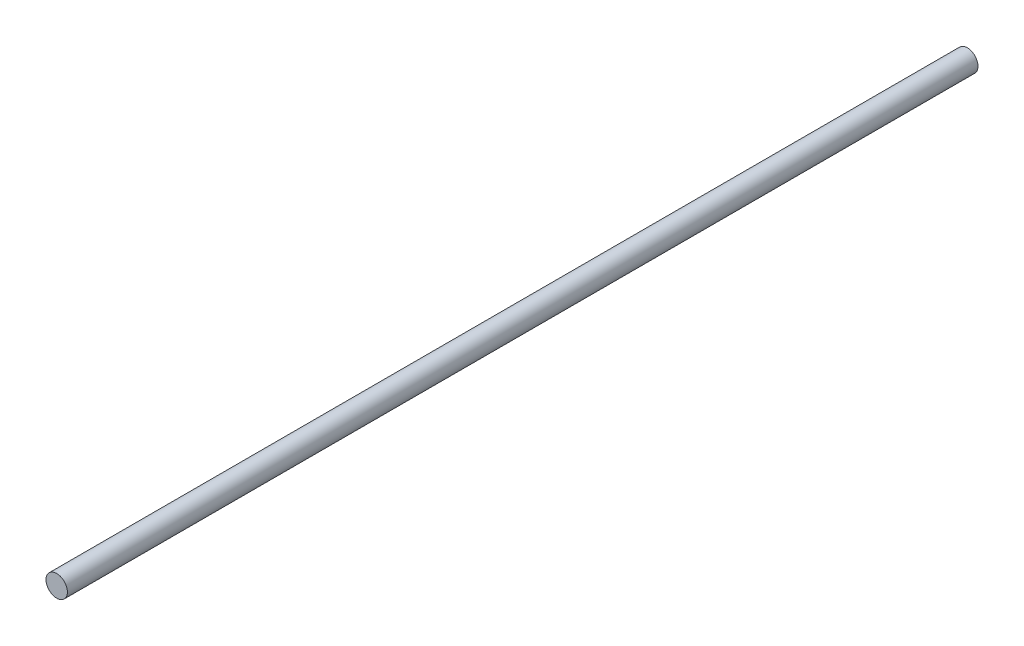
from build123d import *

# Parameters (mm, degrees)
SKETCH1_R           = 30
BOSS_EXTRUDE1_DEPTH = 2550


with BuildPart() as part:
    # Sketch1 → Boss-Extrude1 (new body)
    with BuildSketch(Plane.XY):
        Circle(SKETCH1_R)
    extrude(amount=-BOSS_EXTRUDE1_DEPTH)


solid = part.part
